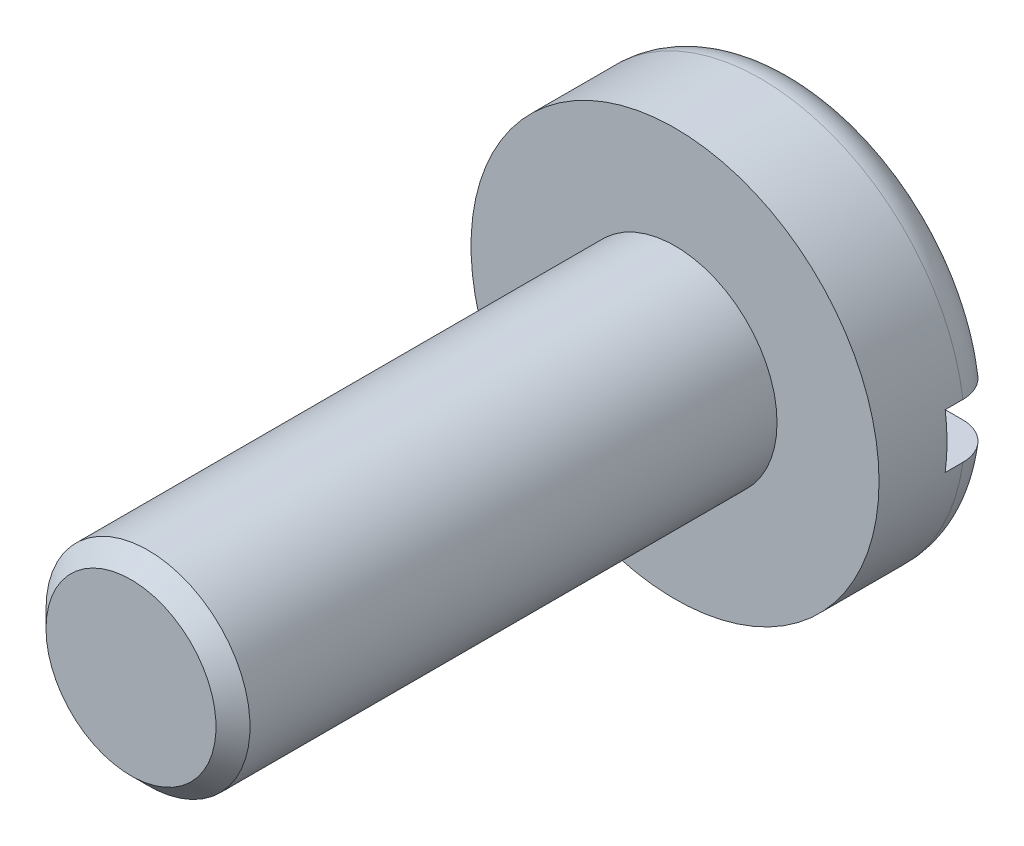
from build123d import *

# Parameters (mm, degrees)
PROFIL_T_TE_R         = 6
TETE_DEPTH            = 3.6
CONGE_R               = 1.08
FENTE_DEPTH           = 10.217374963
FENTE_DEPTH_BACK      = 10.217374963
PROFIL_FENTE_W        = 1.6
PROFIL_FENTE_H        = 1.6
PROFIL_CYLINDRE_R     = 3
CYLINDRE_FILETE_DEPTH = 16


with BuildPart() as part:
    # profil t_te → TETE (new body)
    with BuildSketch(Plane.XY):
        Circle(PROFIL_T_TE_R)
    extrude(amount=TETE_DEPTH)

    # CONGE
    conge_edges = [part.edges().sort_by_distance(p)[0] for p in [
        (-6, 0, 0),
    ]]
    fillet(conge_edges, radius=CONGE_R)

    # profil fente → FENTE (cut, two sides: drawn at the far end of the back side and taken through both)
    with BuildSketch(Plane(origin=(0, 0, 0), x_dir=(0, 0, -1), z_dir=(1, 0, 0)).offset(-FENTE_DEPTH_BACK)):
        with Locations((-0.8, 0)):
            Rectangle(PROFIL_FENTE_W, PROFIL_FENTE_H)
    extrude(amount=FENTE_DEPTH + FENTE_DEPTH_BACK, mode=Mode.SUBTRACT)

    # profil cylindre → CYLINDRE FILETE (add)
    with BuildSketch(Plane.XY.offset(3.6)):
        Circle(PROFIL_CYLINDRE_R)
    extrude(amount=CYLINDRE_FILETE_DEPTH)

    # profil chanfrein → CHANFREIN FILET (revolve, cut)
    with BuildSketch(Plane(origin=(0, 0, 0), x_dir=(0, 0, -1), z_dir=(1, 0, 0)), mode=Mode.PRIVATE) as chanfrein_filet_sk:
        Polygon((-19.6, 2.5), (-19.1, 3), (-19.6, 3), align=None)
    revolve(chanfrein_filet_sk.sketch.rotate(Axis((0, 0, 12.087417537), (0, 0, 1)), 90), axis=Axis((0, 0, 12.087417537), (0, 0, 1)), mode=Mode.SUBTRACT)


solid = part.part
